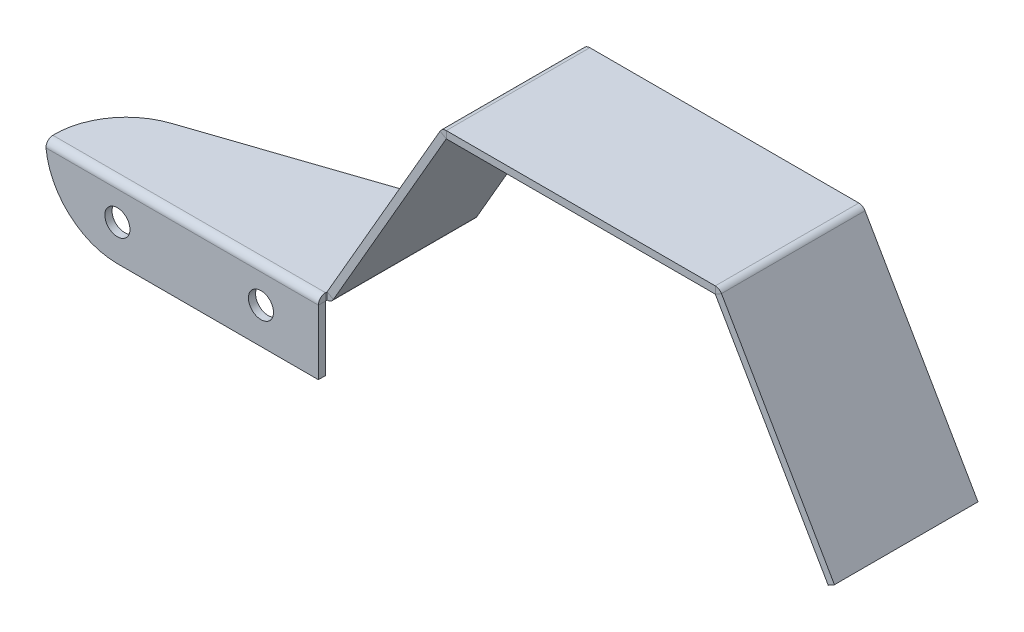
ISO-10303-21;
HEADER;
FILE_DESCRIPTION(('STEP AP214'),'2;1');
FILE_NAME('part.step','',(''),(''),'','','');
FILE_SCHEMA(('AUTOMOTIVE_DESIGN { 1 0 10303 214 1 1 1 1 }'));
ENDSEC;
DATA;
#1=APPLICATION_CONTEXT('core data for automotive mechanical design processes');
#2=APPLICATION_PROTOCOL_DEFINITION('international standard','automotive_design',2000,#1);
#3=PRODUCT_CONTEXT('',#1,'mechanical');
#4=PRODUCT('Part','Part','',(#3));
#5=PRODUCT_RELATED_PRODUCT_CATEGORY('part','',(#4));
#6=PRODUCT_DEFINITION_FORMATION('','',#4);
#7=PRODUCT_DEFINITION_CONTEXT('part definition',#1,'design');
#8=PRODUCT_DEFINITION('design','',#6,#7);
#9=PRODUCT_DEFINITION_SHAPE('','',#8);
#10=(LENGTH_UNIT() NAMED_UNIT(*) SI_UNIT(.MILLI.,.METRE.));
#11=(NAMED_UNIT(*) PLANE_ANGLE_UNIT() SI_UNIT($,.RADIAN.));
#12=(NAMED_UNIT(*) SI_UNIT($,.STERADIAN.) SOLID_ANGLE_UNIT());
#13=UNCERTAINTY_MEASURE_WITH_UNIT(LENGTH_MEASURE(1.E-05),#10,'distance_accuracy_value','');
#14=(GEOMETRIC_REPRESENTATION_CONTEXT(3) GLOBAL_UNCERTAINTY_ASSIGNED_CONTEXT((#13)) GLOBAL_UNIT_ASSIGNED_CONTEXT((#10,
#11,#12)) REPRESENTATION_CONTEXT('',''));
#15=CARTESIAN_POINT('',(0.,0.,0.));
#16=DIRECTION('',(0.,0.,1.));
#17=DIRECTION('',(1.,0.,0.));
#18=AXIS2_PLACEMENT_3D('',#15,#16,#17);
#19=CARTESIAN_POINT('',(-13.3954315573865,-25.202568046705,-1.21503104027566));
#20=DIRECTION('',(-0.86602540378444,0.499999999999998,0.));
#21=DIRECTION('',(0.499999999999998,0.86602540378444,0.));
#22=AXIS2_PLACEMENT_3D('',#19,#20,#21);
#23=PLANE('',#22);
#24=DIRECTION('',(-0.499999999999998,-0.86602540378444,0.));
#25=VECTOR('',#24,1.);
#26=CARTESIAN_POINT('',(51.6045684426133,87.3807344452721,-21.2150310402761));
#27=LINE('',#26,#25);
#28=CARTESIAN_POINT('',(16.6045684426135,26.7589561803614,-21.2150310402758));
#29=VERTEX_POINT('',#28);
#30=CARTESIAN_POINT('',(0.866891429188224,-0.499500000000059,-21.2150310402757));
#31=VERTEX_POINT('',#30);
#32=EDGE_CURVE('E247',#29,#31,#27,.T.);
#33=ORIENTED_EDGE('',*,*,#32,.F.);
#34=DIRECTION('',(0.,0.,1.));
#35=VECTOR('',#34,1.);
#36=CARTESIAN_POINT('',(16.6045684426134,26.7589561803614,-1.21503104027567));
#37=LINE('',#36,#35);
#38=CARTESIAN_POINT('',(16.6045684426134,26.7589561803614,-1.21503104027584));
#39=VERTEX_POINT('',#38);
#40=EDGE_CURVE('E485',#29,#39,#37,.T.);
#41=ORIENTED_EDGE('',*,*,#40,.T.);
#42=DIRECTION('',(0.499999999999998,0.86602540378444,0.));
#43=VECTOR('',#42,1.);
#44=CARTESIAN_POINT('',(0.604568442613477,-0.953856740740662,-1.21503104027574));
#45=LINE('',#44,#43);
#46=CARTESIAN_POINT('',(0.866891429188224,-0.499499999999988,-1.21503104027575));
#47=VERTEX_POINT('',#46);
#48=EDGE_CURVE('E266',#47,#39,#45,.T.);
#49=ORIENTED_EDGE('',*,*,#48,.F.);
#50=DIRECTION('',(0.,0.,-1.));
#51=VECTOR('',#50,1.);
#52=CARTESIAN_POINT('',(0.866891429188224,-0.499499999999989,-1.21503104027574));
#53=LINE('',#52,#51);
#54=EDGE_CURVE('E244',#47,#31,#53,.T.);
#55=ORIENTED_EDGE('',*,*,#54,.T.);
#56=EDGE_LOOP('',(#33,#41,#49,#55));
#57=FACE_BOUND('',#56,.T.);
#58=ADVANCED_FACE('F58',(#57),#23,.F.);
#59=CARTESIAN_POINT('',(-28.,0.,-1.21503104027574));
#60=DIRECTION('',(0.,1.,0.));
#61=DIRECTION('',(1.,0.,0.));
#62=AXIS2_PLACEMENT_3D('',#59,#60,#61);
#63=PLANE('',#62);
#64=DIRECTION('',(0.,0.,-1.));
#65=VECTOR('',#64,1.);
#66=CARTESIAN_POINT('',(0.,0.,-1.21503104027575));
#67=LINE('',#66,#65);
#68=CARTESIAN_POINT('',(0.,0.,-1.001));
#69=VERTEX_POINT('',#68);
#70=CARTESIAN_POINT('',(0.,0.,-1.21503104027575));
#71=VERTEX_POINT('',#70);
#72=EDGE_CURVE('E372',#69,#71,#67,.T.);
#73=ORIENTED_EDGE('',*,*,#72,.T.);
#74=DIRECTION('',(0.,0.,-1.));
#75=VECTOR('',#74,1.);
#76=CARTESIAN_POINT('',(0.,0.,-1.21503104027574));
#77=LINE('',#76,#75);
#78=CARTESIAN_POINT('',(0.,0.,-21.2150310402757));
#79=VERTEX_POINT('',#78);
#80=EDGE_CURVE('E474',#71,#79,#77,.T.);
#81=ORIENTED_EDGE('',*,*,#80,.T.);
#82=DIRECTION('',(-0.947530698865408,0.,0.319664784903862));
#83=VECTOR('',#82,1.);
#84=CARTESIAN_POINT('',(0.,0.,-21.2150310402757));
#85=LINE('',#84,#83);
#86=CARTESIAN_POINT('',(-31.1966478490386,0.,-10.6903380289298));
#87=VERTEX_POINT('',#86);
#88=EDGE_CURVE('E467',#79,#87,#85,.T.);
#89=ORIENTED_EDGE('',*,*,#88,.T.);
#90=CARTESIAN_POINT('',(-28.,0.,-1.21503104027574));
#91=DIRECTION('',(0.,1.,0.));
#92=DIRECTION('',(1.,0.,0.));
#93=AXIS2_PLACEMENT_3D('',#90,#91,#92);
#94=CIRCLE('',#93,10.);
#95=CARTESIAN_POINT('',(-37.9977092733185,0.,-1.001));
#96=VERTEX_POINT('',#95);
#97=EDGE_CURVE('E464',#87,#96,#94,.T.);
#98=ORIENTED_EDGE('',*,*,#97,.T.);
#99=DIRECTION('',(1.,0.,0.));
#100=VECTOR('',#99,1.);
#101=CARTESIAN_POINT('',(-28.,0.,-1.001));
#102=LINE('',#101,#100);
#103=EDGE_CURVE('E452',#96,#69,#102,.T.);
#104=ORIENTED_EDGE('',*,*,#103,.T.);
#105=EDGE_LOOP('',(#73,#81,#89,#98,#104));
#106=FACE_BOUND('',#105,.T.);
#107=ADVANCED_FACE('F438',(#106),#63,.T.);
#108=CARTESIAN_POINT('',(0.,-0.99999999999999,-1.21503104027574));
#109=DIRECTION('',(1.,0.,0.));
#110=DIRECTION('',(0.,0.,-1.));
#111=AXIS2_PLACEMENT_3D('',#108,#109,#110);
#112=PLANE('',#111);
#113=ORIENTED_EDGE('',*,*,#72,.F.);
#114=DIRECTION('',(0.,-1.,0.));
#115=VECTOR('',#114,1.);
#116=CARTESIAN_POINT('',(0.,-0.999999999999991,-1.001));
#117=LINE('',#116,#115);
#118=CARTESIAN_POINT('',(0.,-0.99999999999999,-1.001));
#119=VERTEX_POINT('',#118);
#120=EDGE_CURVE('E461',#69,#119,#117,.T.);
#121=ORIENTED_EDGE('',*,*,#120,.T.);
#122=DIRECTION('',(0.,0.,-1.));
#123=VECTOR('',#122,1.);
#124=CARTESIAN_POINT('',(0.,-0.99999999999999,-1.21503104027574));
#125=LINE('',#124,#123);
#126=CARTESIAN_POINT('',(0.,-0.99999999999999,-1.21503104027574));
#127=VERTEX_POINT('',#126);
#128=EDGE_CURVE('E466',#119,#127,#125,.T.);
#129=ORIENTED_EDGE('',*,*,#128,.T.);
#130=DIRECTION('',(0.,1.,0.));
#131=VECTOR('',#130,1.);
#132=CARTESIAN_POINT('',(0.,-0.99999999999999,-1.21503104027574));
#133=LINE('',#132,#131);
#134=EDGE_CURVE('E477',#127,#71,#133,.T.);
#135=ORIENTED_EDGE('',*,*,#134,.T.);
#136=EDGE_LOOP('',(#113,#121,#129,#135));
#137=FACE_BOUND('',#136,.T.);
#138=ADVANCED_FACE('F435',(#137),#112,.T.);
#139=CARTESIAN_POINT('',(-28.,-0.99999999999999,-1.21503104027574));
#140=DIRECTION('',(0.,1.,0.));
#141=DIRECTION('',(1.,0.,0.));
#142=AXIS2_PLACEMENT_3D('',#139,#140,#141);
#143=CYLINDRICAL_SURFACE('',#142,10.);
#144=CARTESIAN_POINT('',(-28.,-0.99999999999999,-1.21503104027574));
#145=DIRECTION('',(0.,1.,0.));
#146=DIRECTION('',(1.,0.,0.));
#147=AXIS2_PLACEMENT_3D('',#144,#145,#146);
#148=CIRCLE('',#147,10.);
#149=CARTESIAN_POINT('',(-31.1966478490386,-1.00000000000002,-10.6903380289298));
#150=VERTEX_POINT('',#149);
#151=CARTESIAN_POINT('',(-37.9977092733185,-0.99999999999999,-1.001));
#152=VERTEX_POINT('',#151);
#153=EDGE_CURVE('E612',#150,#152,#148,.T.);
#154=ORIENTED_EDGE('',*,*,#153,.T.);
#155=CARTESIAN_POINT('',(-37.9977092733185,0.,-1.001));
#156=CARTESIAN_POINT('',(-37.9977092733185,-0.99999999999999,-1.001));
#157=B_SPLINE_CURVE_WITH_KNOTS('',1,(#155,#156),.UNSPECIFIED.,.F.,.F.,(2,2),(0.,1.),.UNSPECIFIED.);
#158=EDGE_CURVE('E460',#152,#96,#157,.F.);
#159=ORIENTED_EDGE('',*,*,#158,.T.);
#160=ORIENTED_EDGE('',*,*,#97,.F.);
#161=DIRECTION('',(0.,1.,0.));
#162=VECTOR('',#161,1.);
#163=CARTESIAN_POINT('',(-31.1966478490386,-1.00000000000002,-10.6903380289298));
#164=LINE('',#163,#162);
#165=EDGE_CURVE('E986',#150,#87,#164,.T.);
#166=ORIENTED_EDGE('',*,*,#165,.F.);
#167=EDGE_LOOP('',(#154,#159,#160,#166));
#168=FACE_BOUND('',#167,.T.);
#169=ADVANCED_FACE('F433',(#168),#143,.T.);
#170=CARTESIAN_POINT('',(0.,-1.00000000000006,-21.2150310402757));
#171=DIRECTION('',(-0.319664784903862,0.,-0.947530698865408));
#172=DIRECTION('',(-0.947530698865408,0.,0.319664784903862));
#173=AXIS2_PLACEMENT_3D('',#170,#171,#172);
#174=PLANE('',#173);
#175=ORIENTED_EDGE('',*,*,#88,.F.);
#176=DIRECTION('',(0.,1.,0.));
#177=VECTOR('',#176,1.);
#178=CARTESIAN_POINT('',(0.,-1.00000000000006,-21.2150310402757));
#179=LINE('',#178,#177);
#180=CARTESIAN_POINT('',(0.,-1.00000000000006,-21.2150310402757));
#181=VERTEX_POINT('',#180);
#182=EDGE_CURVE('E472',#181,#79,#179,.T.);
#183=ORIENTED_EDGE('',*,*,#182,.F.);
#184=DIRECTION('',(-0.947530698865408,0.,0.319664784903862));
#185=VECTOR('',#184,1.);
#186=CARTESIAN_POINT('',(0.,-1.00000000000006,-21.2150310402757));
#187=LINE('',#186,#185);
#188=EDGE_CURVE('E609',#181,#150,#187,.T.);
#189=ORIENTED_EDGE('',*,*,#188,.T.);
#190=ORIENTED_EDGE('',*,*,#165,.T.);
#191=EDGE_LOOP('',(#175,#183,#189,#190));
#192=FACE_BOUND('',#191,.T.);
#193=ADVANCED_FACE('F429',(#192),#174,.T.);
#194=CARTESIAN_POINT('',(-28.,-0.99999999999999,-1.21503104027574));
#195=DIRECTION('',(0.,1.,0.));
#196=DIRECTION('',(1.,0.,0.));
#197=AXIS2_PLACEMENT_3D('',#194,#195,#196);
#198=PLANE('',#197);
#199=DIRECTION('',(0.,0.,-1.));
#200=VECTOR('',#199,1.);
#201=CARTESIAN_POINT('',(0.,-0.99999999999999,-1.21503104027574));
#202=LINE('',#201,#200);
#203=EDGE_CURVE('E470',#127,#181,#202,.T.);
#204=ORIENTED_EDGE('',*,*,#203,.F.);
#205=ORIENTED_EDGE('',*,*,#128,.F.);
#206=DIRECTION('',(1.,0.,0.));
#207=VECTOR('',#206,1.);
#208=CARTESIAN_POINT('',(-28.,-0.99999999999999,-1.001));
#209=LINE('',#208,#207);
#210=EDGE_CURVE('E988',#152,#119,#209,.T.);
#211=ORIENTED_EDGE('',*,*,#210,.F.);
#212=ORIENTED_EDGE('',*,*,#153,.F.);
#213=ORIENTED_EDGE('',*,*,#188,.F.);
#214=EDGE_LOOP('',(#204,#205,#211,#212,#213));
#215=FACE_BOUND('',#214,.T.);
#216=ADVANCED_FACE('F432',(#215),#198,.F.);
#217=CARTESIAN_POINT('',(0.,-10.,-1.));
#218=DIRECTION('',(0.,-1.,0.));
#219=DIRECTION('',(1.,0.,0.));
#220=AXIS2_PLACEMENT_3D('',#217,#218,#219);
#221=PLANE('',#220);
#222=DIRECTION('',(1.,0.,0.));
#223=VECTOR('',#222,1.);
#224=CARTESIAN_POINT('',(0.,-10.,0.));
#225=LINE('',#224,#223);
#226=CARTESIAN_POINT('',(-28.,-10.,0.));
#227=VERTEX_POINT('',#226);
#228=CARTESIAN_POINT('',(0.,-10.,0.));
#229=VERTEX_POINT('',#228);
#230=EDGE_CURVE('E376',#227,#229,#225,.T.);
#231=ORIENTED_EDGE('',*,*,#230,.F.);
#232=DIRECTION('',(0.,0.,1.));
#233=VECTOR('',#232,1.);
#234=CARTESIAN_POINT('',(-28.,-10.,-1.));
#235=LINE('',#234,#233);
#236=CARTESIAN_POINT('',(-28.,-10.,-1.));
#237=VERTEX_POINT('',#236);
#238=EDGE_CURVE('E364',#237,#227,#235,.T.);
#239=ORIENTED_EDGE('',*,*,#238,.F.);
#240=DIRECTION('',(1.,0.,0.));
#241=VECTOR('',#240,1.);
#242=CARTESIAN_POINT('',(0.,-10.,-1.));
#243=LINE('',#242,#241);
#244=CARTESIAN_POINT('',(0.,-10.,-1.));
#245=VERTEX_POINT('',#244);
#246=EDGE_CURVE('E397',#237,#245,#243,.T.);
#247=ORIENTED_EDGE('',*,*,#246,.T.);
#248=DIRECTION('',(0.,0.,1.));
#249=VECTOR('',#248,1.);
#250=CARTESIAN_POINT('',(0.,-10.,-1.));
#251=LINE('',#250,#249);
#252=EDGE_CURVE('E395',#245,#229,#251,.T.);
#253=ORIENTED_EDGE('',*,*,#252,.T.);
#254=EDGE_LOOP('',(#231,#239,#247,#253));
#255=FACE_BOUND('',#254,.T.);
#256=ADVANCED_FACE('F337',(#255),#221,.T.);
#257=CARTESIAN_POINT('',(-28.,-5.,-1.));
#258=DIRECTION('',(0.,0.,1.));
#259=DIRECTION('',(1.,0.,0.));
#260=AXIS2_PLACEMENT_3D('',#257,#258,#259);
#261=CYLINDRICAL_SURFACE('',#260,1.75);
#262=CARTESIAN_POINT('',(-28.,-5.,-1.));
#263=DIRECTION('',(0.,0.,1.));
#264=DIRECTION('',(1.,0.,0.));
#265=AXIS2_PLACEMENT_3D('',#262,#263,#264);
#266=CIRCLE('',#265,1.75);
#267=CARTESIAN_POINT('',(-26.25,-5.,-1.));
#268=VERTEX_POINT('',#267);
#269=EDGE_CURVE('E383',#268,#268,#266,.T.);
#270=ORIENTED_EDGE('',*,*,#269,.F.);
#271=EDGE_LOOP('',(#270));
#272=FACE_BOUND('',#271,.T.);
#273=CARTESIAN_POINT('',(-28.,-5.,0.));
#274=DIRECTION('',(0.,0.,1.));
#275=DIRECTION('',(1.,0.,0.));
#276=AXIS2_PLACEMENT_3D('',#273,#274,#275);
#277=CIRCLE('',#276,1.75);
#278=CARTESIAN_POINT('',(-26.25,-5.,0.));
#279=VERTEX_POINT('',#278);
#280=EDGE_CURVE('E392',#279,#279,#277,.T.);
#281=ORIENTED_EDGE('',*,*,#280,.T.);
#282=EDGE_LOOP('',(#281));
#283=FACE_BOUND('',#282,.T.);
#284=ADVANCED_FACE('F895',(#272,#283),#261,.F.);
#285=CARTESIAN_POINT('',(-8.,-5.,-1.));
#286=DIRECTION('',(0.,0.,1.));
#287=DIRECTION('',(1.,0.,0.));
#288=AXIS2_PLACEMENT_3D('',#285,#286,#287);
#289=CYLINDRICAL_SURFACE('',#288,1.75);
#290=CARTESIAN_POINT('',(-8.,-5.,-1.));
#291=DIRECTION('',(0.,0.,1.));
#292=DIRECTION('',(1.,0.,0.));
#293=AXIS2_PLACEMENT_3D('',#290,#291,#292);
#294=CIRCLE('',#293,1.75);
#295=CARTESIAN_POINT('',(-6.25,-5.,-1.));
#296=VERTEX_POINT('',#295);
#297=EDGE_CURVE('E386',#296,#296,#294,.T.);
#298=ORIENTED_EDGE('',*,*,#297,.F.);
#299=EDGE_LOOP('',(#298));
#300=FACE_BOUND('',#299,.T.);
#301=CARTESIAN_POINT('',(-8.,-5.,0.));
#302=DIRECTION('',(0.,0.,1.));
#303=DIRECTION('',(1.,0.,0.));
#304=AXIS2_PLACEMENT_3D('',#301,#302,#303);
#305=CIRCLE('',#304,1.75);
#306=CARTESIAN_POINT('',(-6.25,-5.,0.));
#307=VERTEX_POINT('',#306);
#308=EDGE_CURVE('E389',#307,#307,#305,.T.);
#309=ORIENTED_EDGE('',*,*,#308,.T.);
#310=EDGE_LOOP('',(#309));
#311=FACE_BOUND('',#310,.T.);
#312=ADVANCED_FACE('F886',(#300,#311),#289,.F.);
#313=CARTESIAN_POINT('',(-28.,0.,-1.));
#314=DIRECTION('',(0.,0.,1.));
#315=DIRECTION('',(1.,0.,0.));
#316=AXIS2_PLACEMENT_3D('',#313,#314,#315);
#317=PLANE('',#316);
#318=ORIENTED_EDGE('',*,*,#297,.T.);
#319=EDGE_LOOP('',(#318));
#320=FACE_BOUND('',#319,.T.);
#321=ORIENTED_EDGE('',*,*,#269,.T.);
#322=EDGE_LOOP('',(#321));
#323=FACE_BOUND('',#322,.T.);
#324=CARTESIAN_POINT('',(-28.,0.,-1.));
#325=DIRECTION('',(0.,0.,1.));
#326=DIRECTION('',(1.,0.,0.));
#327=AXIS2_PLACEMENT_3D('',#324,#325,#326);
#328=CIRCLE('',#327,10.);
#329=CARTESIAN_POINT('',(-37.9497738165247,-1.00099999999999,-1.));
#330=VERTEX_POINT('',#329);
#331=EDGE_CURVE('E373',#330,#237,#328,.T.);
#332=ORIENTED_EDGE('',*,*,#331,.F.);
#333=DIRECTION('',(1.,0.,0.));
#334=VECTOR('',#333,1.);
#335=CARTESIAN_POINT('',(-28.,-1.00099999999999,-1.));
#336=LINE('',#335,#334);
#337=CARTESIAN_POINT('',(0.,-1.00099999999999,-1.));
#338=VERTEX_POINT('',#337);
#339=EDGE_CURVE('E382',#330,#338,#336,.T.);
#340=ORIENTED_EDGE('',*,*,#339,.T.);
#341=DIRECTION('',(0.,1.,0.));
#342=VECTOR('',#341,1.);
#343=CARTESIAN_POINT('',(0.,0.,-1.));
#344=LINE('',#343,#342);
#345=EDGE_CURVE('E380',#245,#338,#344,.T.);
#346=ORIENTED_EDGE('',*,*,#345,.F.);
#347=ORIENTED_EDGE('',*,*,#246,.F.);
#348=EDGE_LOOP('',(#332,#340,#346,#347));
#349=FACE_BOUND('',#348,.T.);
#350=ADVANCED_FACE('F877',(#320,#323,#349),#317,.F.);
#351=CARTESIAN_POINT('',(0.,0.,-1.));
#352=DIRECTION('',(1.,0.,0.));
#353=DIRECTION('',(0.,1.,0.));
#354=AXIS2_PLACEMENT_3D('',#351,#352,#353);
#355=PLANE('',#354);
#356=DIRECTION('',(0.,0.,-1.));
#357=VECTOR('',#356,1.);
#358=CARTESIAN_POINT('',(0.,-1.00099999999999,-1.00000000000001));
#359=LINE('',#358,#357);
#360=CARTESIAN_POINT('',(0.,-1.001,0.));
#361=VERTEX_POINT('',#360);
#362=EDGE_CURVE('E400',#361,#338,#359,.T.);
#363=ORIENTED_EDGE('',*,*,#362,.F.);
#364=DIRECTION('',(0.,1.,0.));
#365=VECTOR('',#364,1.);
#366=CARTESIAN_POINT('',(0.,0.,0.));
#367=LINE('',#366,#365);
#368=EDGE_CURVE('E374',#229,#361,#367,.T.);
#369=ORIENTED_EDGE('',*,*,#368,.F.);
#370=ORIENTED_EDGE('',*,*,#252,.F.);
#371=ORIENTED_EDGE('',*,*,#345,.T.);
#372=EDGE_LOOP('',(#363,#369,#370,#371));
#373=FACE_BOUND('',#372,.T.);
#374=ADVANCED_FACE('F868',(#373),#355,.T.);
#375=CARTESIAN_POINT('',(-28.,0.,0.));
#376=DIRECTION('',(0.,0.,1.));
#377=DIRECTION('',(1.,0.,0.));
#378=AXIS2_PLACEMENT_3D('',#375,#376,#377);
#379=PLANE('',#378);
#380=DIRECTION('',(1.,0.,0.));
#381=VECTOR('',#380,1.);
#382=CARTESIAN_POINT('',(-28.,-1.001,0.));
#383=LINE('',#382,#381);
#384=CARTESIAN_POINT('',(-37.9497738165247,-1.001,0.));
#385=VERTEX_POINT('',#384);
#386=EDGE_CURVE('E403',#385,#361,#383,.T.);
#387=ORIENTED_EDGE('',*,*,#386,.F.);
#388=CARTESIAN_POINT('',(-28.,0.,0.));
#389=DIRECTION('',(0.,0.,1.));
#390=DIRECTION('',(1.,0.,0.));
#391=AXIS2_PLACEMENT_3D('',#388,#389,#390);
#392=CIRCLE('',#391,10.);
#393=EDGE_CURVE('E379',#385,#227,#392,.T.);
#394=ORIENTED_EDGE('',*,*,#393,.T.);
#395=ORIENTED_EDGE('',*,*,#230,.T.);
#396=ORIENTED_EDGE('',*,*,#368,.T.);
#397=EDGE_LOOP('',(#387,#394,#395,#396));
#398=FACE_BOUND('',#397,.T.);
#399=ORIENTED_EDGE('',*,*,#280,.F.);
#400=EDGE_LOOP('',(#399));
#401=FACE_BOUND('',#400,.T.);
#402=ORIENTED_EDGE('',*,*,#308,.F.);
#403=EDGE_LOOP('',(#402));
#404=FACE_BOUND('',#403,.T.);
#405=ADVANCED_FACE('F427',(#398,#401,#404),#379,.T.);
#406=CARTESIAN_POINT('',(-28.,0.,-1.));
#407=DIRECTION('',(0.,0.,1.));
#408=DIRECTION('',(1.,0.,0.));
#409=AXIS2_PLACEMENT_3D('',#406,#407,#408);
#410=CYLINDRICAL_SURFACE('',#409,10.);
#411=CARTESIAN_POINT('',(-37.9497738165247,-1.00099999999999,-1.));
#412=CARTESIAN_POINT('',(-37.9497738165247,-1.00099999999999,0.));
#413=B_SPLINE_CURVE_WITH_KNOTS('',1,(#411,#412),.UNSPECIFIED.,.F.,.F.,(2,2),(0.,1.),.UNSPECIFIED.);
#414=EDGE_CURVE('E272',#330,#385,#413,.T.);
#415=ORIENTED_EDGE('',*,*,#414,.F.);
#416=ORIENTED_EDGE('',*,*,#331,.T.);
#417=ORIENTED_EDGE('',*,*,#238,.T.);
#418=ORIENTED_EDGE('',*,*,#393,.F.);
#419=EDGE_LOOP('',(#415,#416,#417,#418));
#420=FACE_BOUND('',#419,.T.);
#421=ADVANCED_FACE('F336',(#420),#410,.T.);
#422=CARTESIAN_POINT('',(-37.9497738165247,-1.00099999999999,0.));
#423=CARTESIAN_POINT('',(-37.9549414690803,-0.878717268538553,0.));
#424=CARTESIAN_POINT('',(-37.9598186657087,-0.754071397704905,-0.0226984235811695));
#425=CARTESIAN_POINT('',(-37.9689825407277,-0.518152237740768,-0.115050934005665));
#426=CARTESIAN_POINT('',(-37.9732708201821,-0.406941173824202,-0.184749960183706));
#427=CARTESIAN_POINT('',(-37.9812600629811,-0.216862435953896,-0.365155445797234));
#428=CARTESIAN_POINT('',(-37.9849610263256,-0.138121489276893,-0.475861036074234));
#429=CARTESIAN_POINT('',(-37.9917756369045,-0.029624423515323,-0.723944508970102));
#430=CARTESIAN_POINT('',(-37.9948873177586,0.,-0.861161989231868));
#431=CARTESIAN_POINT('',(-37.9977092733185,0.,-1.001));
#432=CARTESIAN_POINT('',(-37.9497738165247,-1.00099999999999,-1.));
#433=CARTESIAN_POINT('',(-37.9549430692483,-1.00087780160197,-1.));
#434=CARTESIAN_POINT('',(-37.9598186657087,-1.00075331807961,-1.00002267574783));
#435=CARTESIAN_POINT('',(-37.9689825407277,-1.00051763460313,-1.00011493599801));
#436=CARTESIAN_POINT('',(-37.9732708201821,-1.00040653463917,-1.00018456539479));
#437=CARTESIAN_POINT('',(-37.9812600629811,-1.00021664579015,-1.00036479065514));
#438=CARTESIAN_POINT('',(-37.9849610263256,-1.00013798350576,-1.00047538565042));
#439=CARTESIAN_POINT('',(-37.9917756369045,-1.00002959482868,-1.00072322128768));
#440=CARTESIAN_POINT('',(-37.9948892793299,-0.99999999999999,-1.00086039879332));
#441=CARTESIAN_POINT('',(-37.9977092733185,-0.99999999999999,-1.001));
#442=B_SPLINE_SURFACE_WITH_KNOTS('',1,3,((#422,#423,#424,#425,#426,#427,#428,#429,#430,#431),
(#432,#433,#434,#435,#436,#437,#438,#439,#440,#441)),.UNSPECIFIED.,.F.,.F.,.F.,(2,2),(4,2,2,2,
4),(0.,1.),(0.,0.25,0.5,0.75,1.),.UNSPECIFIED.);
#443=CARTESIAN_POINT('',(-37.9497738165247,-1.00099999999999,0.));
#444=CARTESIAN_POINT('',(-37.9549414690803,-0.878717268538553,0.));
#445=CARTESIAN_POINT('',(-37.9598186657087,-0.754071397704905,-0.0226984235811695));
#446=CARTESIAN_POINT('',(-37.9689825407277,-0.518152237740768,-0.115050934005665));
#447=CARTESIAN_POINT('',(-37.9732708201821,-0.406941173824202,-0.184749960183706));
#448=CARTESIAN_POINT('',(-37.9812600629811,-0.216862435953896,-0.365155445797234));
#449=CARTESIAN_POINT('',(-37.9849610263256,-0.138121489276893,-0.475861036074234));
#450=CARTESIAN_POINT('',(-37.9917756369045,-0.029624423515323,-0.723944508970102));
#451=CARTESIAN_POINT('',(-37.9948873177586,0.,-0.861161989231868));
#452=CARTESIAN_POINT('',(-37.9977092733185,0.,-1.001));
#453=B_SPLINE_CURVE_WITH_KNOTS('',3,(#443,#444,#445,#446,#447,#448,#449,#450,#451,#452),
.UNSPECIFIED.,.F.,.F.,(4,2,2,2,4),(0.,0.25,0.5,0.75,1.),.UNSPECIFIED.);
#454=EDGE_CURVE('E263',#385,#96,#453,.T.);
#455=CARTESIAN_POINT('',(-37.9977092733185,-0.99999999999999,-1.001));
#456=CARTESIAN_POINT('',(-37.9948892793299,-0.99999999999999,-1.00086039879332));
#457=CARTESIAN_POINT('',(-37.9917756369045,-1.00002959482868,-1.00072322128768));
#458=CARTESIAN_POINT('',(-37.9849610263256,-1.00013798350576,-1.00047538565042));
#459=CARTESIAN_POINT('',(-37.9812600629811,-1.00021664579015,-1.00036479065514));
#460=CARTESIAN_POINT('',(-37.9732708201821,-1.00040653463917,-1.00018456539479));
#461=CARTESIAN_POINT('',(-37.9689825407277,-1.00051763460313,-1.00011493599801));
#462=CARTESIAN_POINT('',(-37.9598186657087,-1.00075331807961,-1.00002267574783));
#463=CARTESIAN_POINT('',(-37.9549430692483,-1.00087780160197,-1.));
#464=CARTESIAN_POINT('',(-37.9497738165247,-1.00099999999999,-1.));
#465=B_SPLINE_CURVE_WITH_KNOTS('',3,(#455,#456,#457,#458,#459,#460,#461,#462,#463,#464),
.UNSPECIFIED.,.F.,.F.,(4,2,2,2,4),(0.,0.25,0.5,0.75,1.),.UNSPECIFIED.);
#466=EDGE_CURVE('E273',#330,#152,#465,.F.);
#467=ORIENTED_EDGE('',*,*,#414,.T.);
#468=ORIENTED_EDGE('',*,*,#454,.T.);
#469=ORIENTED_EDGE('',*,*,#158,.F.);
#470=ORIENTED_EDGE('',*,*,#466,.F.);
#471=EDGE_LOOP('',(#467,#468,#469,#470));
#472=FACE_BOUND('',#471,.T.);
#473=ADVANCED_FACE('F325',(#472),#442,.F.);
#474=CARTESIAN_POINT('',(0.,-1.00099999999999,-1.001));
#475=DIRECTION('',(-1.,0.,0.));
#476=DIRECTION('',(0.,0.,1.));
#477=AXIS2_PLACEMENT_3D('',#474,#475,#476);
#478=PLANE('',#477);
#479=ORIENTED_EDGE('',*,*,#120,.F.);
#480=CARTESIAN_POINT('',(0.,-1.00099999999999,-1.001));
#481=DIRECTION('',(1.,0.,0.));
#482=DIRECTION('',(0.,0.,-1.));
#483=AXIS2_PLACEMENT_3D('',#480,#481,#482);
#484=CIRCLE('',#483,1.001);
#485=EDGE_CURVE('E274',#69,#361,#484,.T.);
#486=ORIENTED_EDGE('',*,*,#485,.T.);
#487=ORIENTED_EDGE('',*,*,#362,.T.);
#488=CARTESIAN_POINT('',(0.,-1.00099999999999,-1.001));
#489=DIRECTION('',(1.,0.,0.));
#490=DIRECTION('',(0.,0.,1.));
#491=AXIS2_PLACEMENT_3D('',#488,#489,#490);
#492=CIRCLE('',#491,0.000999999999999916);
#493=EDGE_CURVE('E269',#119,#338,#492,.T.);
#494=ORIENTED_EDGE('',*,*,#493,.F.);
#495=EDGE_LOOP('',(#479,#486,#487,#494));
#496=FACE_BOUND('',#495,.T.);
#497=ADVANCED_FACE('F294',(#496),#478,.F.);
#498=CARTESIAN_POINT('',(-56.9938983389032,-1.00099999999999,-1.001));
#499=DIRECTION('',(1.,0.,0.));
#500=DIRECTION('',(0.,0.,-1.));
#501=AXIS2_PLACEMENT_3D('',#498,#499,#500);
#502=CYLINDRICAL_SURFACE('',#501,0.001);
#503=ORIENTED_EDGE('',*,*,#493,.T.);
#504=ORIENTED_EDGE('',*,*,#339,.F.);
#505=ORIENTED_EDGE('',*,*,#466,.T.);
#506=ORIENTED_EDGE('',*,*,#210,.T.);
#507=EDGE_LOOP('',(#503,#504,#505,#506));
#508=FACE_BOUND('',#507,.T.);
#509=ADVANCED_FACE('F283',(#508),#502,.F.);
#510=CARTESIAN_POINT('',(-56.9938983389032,-1.00099999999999,-1.001));
#511=DIRECTION('',(1.,0.,0.));
#512=DIRECTION('',(0.,0.,-1.));
#513=AXIS2_PLACEMENT_3D('',#510,#511,#512);
#514=CYLINDRICAL_SURFACE('',#513,1.001);
#515=ORIENTED_EDGE('',*,*,#485,.F.);
#516=ORIENTED_EDGE('',*,*,#103,.F.);
#517=ORIENTED_EDGE('',*,*,#454,.F.);
#518=ORIENTED_EDGE('',*,*,#386,.T.);
#519=EDGE_LOOP('',(#515,#516,#517,#518));
#520=FACE_BOUND('',#519,.T.);
#521=ADVANCED_FACE('F293',(#520),#514,.T.);
#522=CARTESIAN_POINT('',(0.,0.00100000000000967,-1.21503104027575));
#523=DIRECTION('',(0.,0.,1.));
#524=DIRECTION('',(0.,-1.,0.));
#525=AXIS2_PLACEMENT_3D('',#522,#523,#524);
#526=PLANE('',#525);
#527=DIRECTION('',(-0.86602540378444,0.499999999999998,0.));
#528=VECTOR('',#527,1.);
#529=CARTESIAN_POINT('',(0.866891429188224,-0.499499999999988,-1.21503104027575));
#530=LINE('',#529,#528);
#531=CARTESIAN_POINT('',(0.000866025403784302,0.000500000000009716,-1.21503104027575));
#532=VERTEX_POINT('',#531);
#533=EDGE_CURVE('E243',#47,#532,#530,.T.);
#534=ORIENTED_EDGE('',*,*,#533,.T.);
#535=CARTESIAN_POINT('',(0.,0.00100000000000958,-1.21503104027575));
#536=DIRECTION('',(0.,0.,1.));
#537=DIRECTION('',(0.,-1.,0.));
#538=AXIS2_PLACEMENT_3D('',#535,#536,#537);
#539=CIRCLE('',#538,0.000999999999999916);
#540=EDGE_CURVE('E264',#532,#71,#539,.F.);
#541=ORIENTED_EDGE('',*,*,#540,.T.);
#542=ORIENTED_EDGE('',*,*,#134,.F.);
#543=CARTESIAN_POINT('',(0.,0.00100000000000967,-1.21503104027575));
#544=DIRECTION('',(0.,0.,-1.));
#545=DIRECTION('',(0.,-1.,0.));
#546=AXIS2_PLACEMENT_3D('',#543,#544,#545);
#547=CIRCLE('',#546,1.001);
#548=EDGE_CURVE('E256',#47,#127,#547,.T.);
#549=ORIENTED_EDGE('',*,*,#548,.F.);
#550=EDGE_LOOP('',(#534,#541,#542,#549));
#551=FACE_BOUND('',#550,.T.);
#552=ADVANCED_FACE('F301',(#551),#526,.T.);
#553=CARTESIAN_POINT('',(0.,0.000999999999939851,-21.2150310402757));
#554=DIRECTION('',(0.,0.,-1.));
#555=DIRECTION('',(0.,1.,0.));
#556=AXIS2_PLACEMENT_3D('',#553,#554,#555);
#557=PLANE('',#556);
#558=CARTESIAN_POINT('',(0.,0.000999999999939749,-21.2150310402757));
#559=DIRECTION('',(0.,0.,1.));
#560=DIRECTION('',(0.,-1.,0.));
#561=AXIS2_PLACEMENT_3D('',#558,#559,#560);
#562=CIRCLE('',#561,0.000999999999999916);
#563=CARTESIAN_POINT('',(0.000866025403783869,0.000499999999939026,-21.2150310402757));
#564=VERTEX_POINT('',#563);
#565=EDGE_CURVE('E260',#79,#564,#562,.T.);
#566=ORIENTED_EDGE('',*,*,#565,.T.);
#567=DIRECTION('',(0.86602540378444,-0.499999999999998,0.));
#568=VECTOR('',#567,1.);
#569=CARTESIAN_POINT('',(0.866891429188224,-0.499500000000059,-21.2150310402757));
#570=LINE('',#569,#568);
#571=EDGE_CURVE('E248',#564,#31,#570,.T.);
#572=ORIENTED_EDGE('',*,*,#571,.T.);
#573=CARTESIAN_POINT('',(0.,0.000999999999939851,-21.2150310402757));
#574=DIRECTION('',(0.,0.,1.));
#575=DIRECTION('',(0.,1.,0.));
#576=AXIS2_PLACEMENT_3D('',#573,#574,#575);
#577=CIRCLE('',#576,1.001);
#578=EDGE_CURVE('E259',#181,#31,#577,.T.);
#579=ORIENTED_EDGE('',*,*,#578,.F.);
#580=ORIENTED_EDGE('',*,*,#182,.T.);
#581=EDGE_LOOP('',(#566,#572,#579,#580));
#582=FACE_BOUND('',#581,.T.);
#583=ADVANCED_FACE('F296',(#582),#557,.T.);
#584=CARTESIAN_POINT('',(0.,0.000999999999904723,-31.2468870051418));
#585=DIRECTION('',(0.,0.,1.));
#586=DIRECTION('',(0.,-1.,0.));
#587=AXIS2_PLACEMENT_3D('',#584,#585,#586);
#588=CYLINDRICAL_SURFACE('',#587,1.001);
#589=ORIENTED_EDGE('',*,*,#203,.T.);
#590=ORIENTED_EDGE('',*,*,#578,.T.);
#591=ORIENTED_EDGE('',*,*,#54,.F.);
#592=ORIENTED_EDGE('',*,*,#548,.T.);
#593=EDGE_LOOP('',(#589,#590,#591,#592));
#594=FACE_BOUND('',#593,.T.);
#595=ADVANCED_FACE('F602',(#594),#588,.T.);
#596=CARTESIAN_POINT('',(0.,0.000999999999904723,-31.2468870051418));
#597=DIRECTION('',(0.,0.,1.));
#598=DIRECTION('',(0.,-1.,0.));
#599=AXIS2_PLACEMENT_3D('',#596,#597,#598);
#600=CYLINDRICAL_SURFACE('',#599,0.000999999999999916);
#601=ORIENTED_EDGE('',*,*,#80,.F.);
#602=ORIENTED_EDGE('',*,*,#540,.F.);
#603=DIRECTION('',(0.,0.,-1.));
#604=VECTOR('',#603,1.);
#605=CARTESIAN_POINT('',(0.000866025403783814,0.000500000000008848,-1.21503104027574));
#606=LINE('',#605,#604);
#607=EDGE_CURVE('E251',#532,#564,#606,.T.);
#608=ORIENTED_EDGE('',*,*,#607,.T.);
#609=ORIENTED_EDGE('',*,*,#565,.F.);
#610=EDGE_LOOP('',(#601,#602,#608,#609));
#611=FACE_BOUND('',#610,.T.);
#612=ADVANCED_FACE('F590',(#611),#600,.F.);
#613=CARTESIAN_POINT('',(51.6045684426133,87.3807344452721,-21.2150310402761));
#614=DIRECTION('',(0.,0.,-1.));
#615=DIRECTION('',(-0.499999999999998,-0.86602540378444,0.));
#616=AXIS2_PLACEMENT_3D('',#613,#614,#615);
#617=PLANE('',#616);
#618=DIRECTION('',(-0.86602540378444,0.499999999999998,0.));
#619=VECTOR('',#618,1.);
#620=CARTESIAN_POINT('',(16.6045684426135,26.7589561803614,-21.2150310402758));
#621=LINE('',#620,#619);
#622=CARTESIAN_POINT('',(15.738543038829,27.2589561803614,-21.2150310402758));
#623=VERTEX_POINT('',#622);
#624=EDGE_CURVE('E488',#29,#623,#621,.T.);
#625=ORIENTED_EDGE('',*,*,#624,.F.);
#626=ORIENTED_EDGE('',*,*,#32,.T.);
#627=ORIENTED_EDGE('',*,*,#571,.F.);
#628=DIRECTION('',(-0.499999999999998,-0.86602540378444,0.));
#629=VECTOR('',#628,1.);
#630=CARTESIAN_POINT('',(50.7385430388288,87.8807344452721,-21.2150310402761));
#631=LINE('',#630,#629);
#632=EDGE_CURVE('E496',#623,#564,#631,.T.);
#633=ORIENTED_EDGE('',*,*,#632,.F.);
#634=EDGE_LOOP('',(#625,#626,#627,#633));
#635=FACE_BOUND('',#634,.T.);
#636=ADVANCED_FACE('F556',(#635),#617,.T.);
#637=CARTESIAN_POINT('',(-14.2614569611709,-24.702568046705,-1.21503104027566));
#638=DIRECTION('',(-0.86602540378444,0.499999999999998,0.));
#639=DIRECTION('',(0.499999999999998,0.86602540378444,0.));
#640=AXIS2_PLACEMENT_3D('',#637,#638,#639);
#641=PLANE('',#640);
#642=DIRECTION('',(0.,0.,1.));
#643=VECTOR('',#642,1.);
#644=CARTESIAN_POINT('',(15.738543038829,27.2589561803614,-1.21503104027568));
#645=LINE('',#644,#643);
#646=CARTESIAN_POINT('',(15.738543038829,27.2589561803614,-1.21503104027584));
#647=VERTEX_POINT('',#646);
#648=EDGE_CURVE('E480',#623,#647,#645,.T.);
#649=ORIENTED_EDGE('',*,*,#648,.F.);
#650=ORIENTED_EDGE('',*,*,#632,.T.);
#651=ORIENTED_EDGE('',*,*,#607,.F.);
#652=DIRECTION('',(0.499999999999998,0.86602540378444,0.));
#653=VECTOR('',#652,1.);
#654=CARTESIAN_POINT('',(-0.261456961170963,-0.453856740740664,-1.21503104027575));
#655=LINE('',#654,#653);
#656=EDGE_CURVE('E493',#532,#647,#655,.T.);
#657=ORIENTED_EDGE('',*,*,#656,.T.);
#658=EDGE_LOOP('',(#649,#650,#651,#657));
#659=FACE_BOUND('',#658,.T.);
#660=ADVANCED_FACE('F561',(#659),#641,.T.);
#661=CARTESIAN_POINT('',(0.604568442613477,-0.953856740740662,-1.21503104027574));
#662=DIRECTION('',(0.,0.,1.));
#663=DIRECTION('',(0.86602540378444,-0.499999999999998,0.));
#664=AXIS2_PLACEMENT_3D('',#661,#662,#663);
#665=PLANE('',#664);
#666=DIRECTION('',(0.86602540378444,-0.499999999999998,0.));
#667=VECTOR('',#666,1.);
#668=CARTESIAN_POINT('',(16.6045684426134,26.7589561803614,-1.21503104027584));
#669=LINE('',#668,#667);
#670=EDGE_CURVE('E483',#647,#39,#669,.T.);
#671=ORIENTED_EDGE('',*,*,#670,.F.);
#672=ORIENTED_EDGE('',*,*,#656,.F.);
#673=ORIENTED_EDGE('',*,*,#533,.F.);
#674=ORIENTED_EDGE('',*,*,#48,.T.);
#675=EDGE_LOOP('',(#671,#672,#673,#674));
#676=FACE_BOUND('',#675,.T.);
#677=ADVANCED_FACE('F557',(#676),#665,.T.);
#678=CARTESIAN_POINT('',(16.6045684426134,26.7589561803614,-1.21503104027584));
#679=DIRECTION('',(0.,0.,1.));
#680=DIRECTION('',(1.,0.,0.));
#681=AXIS2_PLACEMENT_3D('',#678,#679,#680);
#682=CYLINDRICAL_SURFACE('',#681,1.);
#683=CARTESIAN_POINT('',(16.6045684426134,26.7589561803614,-1.21503104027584));
#684=DIRECTION('',(0.,0.,1.));
#685=DIRECTION('',(1.,0.,0.));
#686=AXIS2_PLACEMENT_3D('',#683,#684,#685);
#687=CIRCLE('',#686,1.);
#688=CARTESIAN_POINT('',(16.6045684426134,27.7589561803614,-1.21503104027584));
#689=VERTEX_POINT('',#688);
#690=EDGE_CURVE('E240',#689,#647,#687,.T.);
#691=ORIENTED_EDGE('',*,*,#690,.F.);
#692=DIRECTION('',(0.,0.,1.));
#693=VECTOR('',#692,1.);
#694=CARTESIAN_POINT('',(16.6045684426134,27.7589561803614,-1.21503104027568));
#695=LINE('',#694,#693);
#696=CARTESIAN_POINT('',(16.6045684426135,27.7589561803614,-21.2150310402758));
#697=VERTEX_POINT('',#696);
#698=EDGE_CURVE('E236',#697,#689,#695,.T.);
#699=ORIENTED_EDGE('',*,*,#698,.F.);
#700=CARTESIAN_POINT('',(16.6045684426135,26.7589561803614,-21.2150310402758));
#701=DIRECTION('',(0.,0.,1.));
#702=DIRECTION('',(1.,0.,0.));
#703=AXIS2_PLACEMENT_3D('',#700,#701,#702);
#704=CIRCLE('',#703,1.);
#705=EDGE_CURVE('E231',#697,#623,#704,.T.);
#706=ORIENTED_EDGE('',*,*,#705,.T.);
#707=ORIENTED_EDGE('',*,*,#648,.T.);
#708=EDGE_LOOP('',(#691,#699,#706,#707));
#709=FACE_BOUND('',#708,.T.);
#710=ADVANCED_FACE('F560',(#709),#682,.T.);
#711=CARTESIAN_POINT('',(16.6045684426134,26.7589561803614,-1.21503104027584));
#712=DIRECTION('',(0.,0.,-1.));
#713=DIRECTION('',(-1.,0.,0.));
#714=AXIS2_PLACEMENT_3D('',#711,#712,#713);
#715=PLANE('',#714);
#716=ORIENTED_EDGE('',*,*,#670,.T.);
#717=DIRECTION('',(0.,-1.,0.));
#718=VECTOR('',#717,1.);
#719=CARTESIAN_POINT('',(16.6045684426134,26.7589561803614,-1.21503104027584));
#720=LINE('',#719,#718);
#721=EDGE_CURVE('E232',#689,#39,#720,.T.);
#722=ORIENTED_EDGE('',*,*,#721,.F.);
#723=ORIENTED_EDGE('',*,*,#690,.T.);
#724=EDGE_LOOP('',(#716,#722,#723));
#725=FACE_BOUND('',#724,.T.);
#726=ADVANCED_FACE('F571',(#725),#715,.F.);
#727=CARTESIAN_POINT('',(16.6045684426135,26.7589561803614,-21.2150310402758));
#728=DIRECTION('',(0.,0.,1.));
#729=DIRECTION('',(1.,0.,0.));
#730=AXIS2_PLACEMENT_3D('',#727,#728,#729);
#731=PLANE('',#730);
#732=DIRECTION('',(0.,1.,0.));
#733=VECTOR('',#732,1.);
#734=CARTESIAN_POINT('',(16.6045684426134,26.7589561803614,-21.2150310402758));
#735=LINE('',#734,#733);
#736=EDGE_CURVE('E228',#29,#697,#735,.T.);
#737=ORIENTED_EDGE('',*,*,#736,.F.);
#738=ORIENTED_EDGE('',*,*,#624,.T.);
#739=ORIENTED_EDGE('',*,*,#705,.F.);
#740=EDGE_LOOP('',(#737,#738,#739));
#741=FACE_BOUND('',#740,.T.);
#742=ADVANCED_FACE('F567',(#741),#731,.F.);
#743=CARTESIAN_POINT('',(-43.9190303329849,27.7589561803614,-1.21503104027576));
#744=DIRECTION('',(0.,1.,0.));
#745=DIRECTION('',(1.,0.,0.));
#746=AXIS2_PLACEMENT_3D('',#743,#744,#745);
#747=PLANE('',#746);
#748=DIRECTION('',(0.,0.,1.));
#749=VECTOR('',#748,1.);
#750=CARTESIAN_POINT('',(54.0809696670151,27.7589561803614,-1.2150310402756));
#751=LINE('',#750,#749);
#752=CARTESIAN_POINT('',(54.0809696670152,27.7589561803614,-21.2150310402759));
#753=VERTEX_POINT('',#752);
#754=CARTESIAN_POINT('',(54.0809696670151,27.7589561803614,-1.21503104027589));
#755=VERTEX_POINT('',#754);
#756=EDGE_CURVE('E491',#753,#755,#751,.T.);
#757=ORIENTED_EDGE('',*,*,#756,.F.);
#758=DIRECTION('',(-1.,0.,0.));
#759=VECTOR('',#758,1.);
#760=CARTESIAN_POINT('',(86.0809696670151,27.7589561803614,-21.2150310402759));
#761=LINE('',#760,#759);
#762=EDGE_CURVE('E62',#753,#697,#761,.T.);
#763=ORIENTED_EDGE('',*,*,#762,.T.);
#764=ORIENTED_EDGE('',*,*,#698,.T.);
#765=DIRECTION('',(1.,0.,0.));
#766=VECTOR('',#765,1.);
#767=CARTESIAN_POINT('',(-15.9190303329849,27.7589561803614,-1.2150310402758));
#768=LINE('',#767,#766);
#769=EDGE_CURVE('E83',#689,#755,#768,.T.);
#770=ORIENTED_EDGE('',*,*,#769,.T.);
#771=EDGE_LOOP('',(#757,#763,#764,#770));
#772=FACE_BOUND('',#771,.T.);
#773=ADVANCED_FACE('F545',(#772),#747,.T.);
#774=CARTESIAN_POINT('',(-15.9190303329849,26.7589561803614,-1.2150310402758));
#775=DIRECTION('',(0.,0.,1.));
#776=DIRECTION('',(0.,-1.,0.));
#777=AXIS2_PLACEMENT_3D('',#774,#775,#776);
#778=PLANE('',#777);
#779=DIRECTION('',(0.,-1.,0.));
#780=VECTOR('',#779,1.);
#781=CARTESIAN_POINT('',(54.0809696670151,26.7589561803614,-1.21503104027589));
#782=LINE('',#781,#780);
#783=CARTESIAN_POINT('',(54.0809696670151,26.7589561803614,-1.2150310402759));
#784=VERTEX_POINT('',#783);
#785=EDGE_CURVE('E501',#755,#784,#782,.T.);
#786=ORIENTED_EDGE('',*,*,#785,.F.);
#787=ORIENTED_EDGE('',*,*,#769,.F.);
#788=ORIENTED_EDGE('',*,*,#721,.T.);
#789=DIRECTION('',(1.,0.,0.));
#790=VECTOR('',#789,1.);
#791=CARTESIAN_POINT('',(-15.9190303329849,26.7589561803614,-1.2150310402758));
#792=LINE('',#791,#790);
#793=EDGE_CURVE('E235',#39,#784,#792,.T.);
#794=ORIENTED_EDGE('',*,*,#793,.T.);
#795=EDGE_LOOP('',(#786,#787,#788,#794));
#796=FACE_BOUND('',#795,.T.);
#797=ADVANCED_FACE('F508',(#796),#778,.T.);
#798=CARTESIAN_POINT('',(-43.9190303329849,26.7589561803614,-1.21503104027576));
#799=DIRECTION('',(0.,1.,0.));
#800=DIRECTION('',(1.,0.,0.));
#801=AXIS2_PLACEMENT_3D('',#798,#799,#800);
#802=PLANE('',#801);
#803=DIRECTION('',(-1.,0.,0.));
#804=VECTOR('',#803,1.);
#805=CARTESIAN_POINT('',(86.0809696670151,26.7589561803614,-21.2150310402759));
#806=LINE('',#805,#804);
#807=CARTESIAN_POINT('',(54.0809696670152,26.7589561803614,-21.2150310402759));
#808=VERTEX_POINT('',#807);
#809=EDGE_CURVE('E75',#808,#29,#806,.T.);
#810=ORIENTED_EDGE('',*,*,#809,.F.);
#811=DIRECTION('',(0.,0.,1.));
#812=VECTOR('',#811,1.);
#813=CARTESIAN_POINT('',(54.0809696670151,26.7589561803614,-1.2150310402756));
#814=LINE('',#813,#812);
#815=EDGE_CURVE('E67',#808,#784,#814,.T.);
#816=ORIENTED_EDGE('',*,*,#815,.T.);
#817=ORIENTED_EDGE('',*,*,#793,.F.);
#818=ORIENTED_EDGE('',*,*,#40,.F.);
#819=EDGE_LOOP('',(#810,#816,#817,#818));
#820=FACE_BOUND('',#819,.T.);
#821=ADVANCED_FACE('F538',(#820),#802,.F.);
#822=CARTESIAN_POINT('',(86.0809696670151,26.7589561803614,-21.2150310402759));
#823=DIRECTION('',(0.,0.,-1.));
#824=DIRECTION('',(-1.,0.,0.));
#825=AXIS2_PLACEMENT_3D('',#822,#823,#824);
#826=PLANE('',#825);
#827=DIRECTION('',(0.,1.,0.));
#828=VECTOR('',#827,1.);
#829=CARTESIAN_POINT('',(54.0809696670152,26.7589561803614,-21.2150310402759));
#830=LINE('',#829,#828);
#831=EDGE_CURVE('E12',#808,#753,#830,.T.);
#832=ORIENTED_EDGE('',*,*,#831,.F.);
#833=ORIENTED_EDGE('',*,*,#809,.T.);
#834=ORIENTED_EDGE('',*,*,#736,.T.);
#835=ORIENTED_EDGE('',*,*,#762,.F.);
#836=EDGE_LOOP('',(#832,#833,#834,#835));
#837=FACE_BOUND('',#836,.T.);
#838=ADVANCED_FACE('F60',(#837),#826,.T.);
#839=CARTESIAN_POINT('',(54.0809696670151,26.7589561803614,-1.21503104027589));
#840=DIRECTION('',(0.,0.,1.));
#841=DIRECTION('',(1.,0.,0.));
#842=AXIS2_PLACEMENT_3D('',#839,#840,#841);
#843=CYLINDRICAL_SURFACE('',#842,1.00000000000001);
#844=CARTESIAN_POINT('',(54.0809696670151,26.7589561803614,-1.21503104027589));
#845=DIRECTION('',(0.,0.,1.));
#846=DIRECTION('',(1.,0.,0.));
#847=AXIS2_PLACEMENT_3D('',#844,#845,#846);
#848=CIRCLE('',#847,1.00000000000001);
#849=CARTESIAN_POINT('',(54.9469950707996,27.2589561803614,-1.21503104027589));
#850=VERTEX_POINT('',#849);
#851=EDGE_CURVE('E225',#850,#755,#848,.T.);
#852=ORIENTED_EDGE('',*,*,#851,.F.);
#853=DIRECTION('',(0.,0.,1.));
#854=VECTOR('',#853,1.);
#855=CARTESIAN_POINT('',(54.9469950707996,27.2589561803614,-1.2150310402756));
#856=LINE('',#855,#854);
#857=CARTESIAN_POINT('',(54.9469950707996,27.2589561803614,-21.2150310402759));
#858=VERTEX_POINT('',#857);
#859=EDGE_CURVE('E527',#858,#850,#856,.T.);
#860=ORIENTED_EDGE('',*,*,#859,.F.);
#861=CARTESIAN_POINT('',(54.0809696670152,26.7589561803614,-21.2150310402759));
#862=DIRECTION('',(0.,0.,1.));
#863=DIRECTION('',(1.,0.,0.));
#864=AXIS2_PLACEMENT_3D('',#861,#862,#863);
#865=CIRCLE('',#864,1.00000000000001);
#866=EDGE_CURVE('E222',#858,#753,#865,.T.);
#867=ORIENTED_EDGE('',*,*,#866,.T.);
#868=ORIENTED_EDGE('',*,*,#756,.T.);
#869=EDGE_LOOP('',(#852,#860,#867,#868));
#870=FACE_BOUND('',#869,.T.);
#871=ADVANCED_FACE('F536',(#870),#843,.T.);
#872=CARTESIAN_POINT('',(54.0809696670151,26.7589561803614,-1.21503104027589));
#873=DIRECTION('',(0.,0.,-1.));
#874=DIRECTION('',(-1.,0.,0.));
#875=AXIS2_PLACEMENT_3D('',#872,#873,#874);
#876=PLANE('',#875);
#877=ORIENTED_EDGE('',*,*,#785,.T.);
#878=DIRECTION('',(-0.86602540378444,-0.499999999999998,0.));
#879=VECTOR('',#878,1.);
#880=CARTESIAN_POINT('',(54.0809696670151,26.7589561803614,-1.2150310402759));
#881=LINE('',#880,#879);
#882=EDGE_CURVE('E513',#850,#784,#881,.T.);
#883=ORIENTED_EDGE('',*,*,#882,.F.);
#884=ORIENTED_EDGE('',*,*,#851,.T.);
#885=EDGE_LOOP('',(#877,#883,#884));
#886=FACE_BOUND('',#885,.T.);
#887=ADVANCED_FACE('F537',(#886),#876,.F.);
#888=CARTESIAN_POINT('',(54.0809696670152,26.7589561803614,-21.2150310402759));
#889=DIRECTION('',(0.,0.,1.));
#890=DIRECTION('',(1.,0.,0.));
#891=AXIS2_PLACEMENT_3D('',#888,#889,#890);
#892=PLANE('',#891);
#893=DIRECTION('',(0.86602540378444,0.499999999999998,0.));
#894=VECTOR('',#893,1.);
#895=CARTESIAN_POINT('',(54.0809696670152,26.7589561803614,-21.2150310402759));
#896=LINE('',#895,#894);
#897=EDGE_CURVE('E213',#808,#858,#896,.T.);
#898=ORIENTED_EDGE('',*,*,#897,.F.);
#899=ORIENTED_EDGE('',*,*,#831,.T.);
#900=ORIENTED_EDGE('',*,*,#866,.F.);
#901=EDGE_LOOP('',(#898,#899,#900));
#902=FACE_BOUND('',#901,.T.);
#903=ADVANCED_FACE('F534',(#902),#892,.F.);
#904=CARTESIAN_POINT('',(69.8191702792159,-0.500406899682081,-1.21503104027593));
#905=DIRECTION('',(0.499999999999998,-0.86602540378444,0.));
#906=DIRECTION('',(-0.86602540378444,-0.499999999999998,0.));
#907=AXIS2_PLACEMENT_3D('',#904,#905,#906);
#908=PLANE('',#907);
#909=DIRECTION('',(0.,0.,-1.));
#910=VECTOR('',#909,1.);
#911=CARTESIAN_POINT('',(70.6851956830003,-0.000406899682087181,-1.21503104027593));
#912=LINE('',#911,#910);
#913=CARTESIAN_POINT('',(70.6851956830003,-0.000406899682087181,-1.21503104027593));
#914=VERTEX_POINT('',#913);
#915=CARTESIAN_POINT('',(70.6851956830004,-0.000406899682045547,-21.2150310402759));
#916=VERTEX_POINT('',#915);
#917=EDGE_CURVE('E521',#914,#916,#912,.T.);
#918=ORIENTED_EDGE('',*,*,#917,.F.);
#919=DIRECTION('',(0.86602540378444,0.499999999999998,0.));
#920=VECTOR('',#919,1.);
#921=CARTESIAN_POINT('',(69.8191702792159,-0.500406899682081,-1.21503104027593));
#922=LINE('',#921,#920);
#923=CARTESIAN_POINT('',(69.8191702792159,-0.500406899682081,-1.21503104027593));
#924=VERTEX_POINT('',#923);
#925=EDGE_CURVE('E214',#924,#914,#922,.T.);
#926=ORIENTED_EDGE('',*,*,#925,.F.);
#927=DIRECTION('',(0.,0.,-1.));
#928=VECTOR('',#927,1.);
#929=CARTESIAN_POINT('',(69.8191702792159,-0.500406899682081,-1.21503104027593));
#930=LINE('',#929,#928);
#931=CARTESIAN_POINT('',(69.8191702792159,-0.500406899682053,-21.2150310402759));
#932=VERTEX_POINT('',#931);
#933=EDGE_CURVE('E207',#924,#932,#930,.T.);
#934=ORIENTED_EDGE('',*,*,#933,.T.);
#935=DIRECTION('',(0.86602540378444,0.499999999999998,0.));
#936=VECTOR('',#935,1.);
#937=CARTESIAN_POINT('',(69.8191702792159,-0.500406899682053,-21.2150310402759));
#938=LINE('',#937,#936);
#939=EDGE_CURVE('E195',#932,#916,#938,.T.);
#940=ORIENTED_EDGE('',*,*,#939,.T.);
#941=EDGE_LOOP('',(#918,#926,#934,#940));
#942=FACE_BOUND('',#941,.T.);
#943=ADVANCED_FACE('F217',(#942),#908,.T.);
#944=CARTESIAN_POINT('',(5.6851956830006,112.582895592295,-1.21503104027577));
#945=DIRECTION('',(0.86602540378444,0.499999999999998,0.));
#946=DIRECTION('',(0.499999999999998,-0.86602540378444,0.));
#947=AXIS2_PLACEMENT_3D('',#944,#945,#946);
#948=PLANE('',#947);
#949=DIRECTION('',(-0.499999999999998,0.86602540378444,0.));
#950=VECTOR('',#949,1.);
#951=CARTESIAN_POINT('',(70.6851956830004,-0.000406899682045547,-21.2150310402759));
#952=LINE('',#951,#950);
#953=EDGE_CURVE('E202',#916,#858,#952,.T.);
#954=ORIENTED_EDGE('',*,*,#953,.T.);
#955=ORIENTED_EDGE('',*,*,#859,.T.);
#956=DIRECTION('',(0.499999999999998,-0.86602540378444,0.));
#957=VECTOR('',#956,1.);
#958=CARTESIAN_POINT('',(19.6851956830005,88.3341842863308,-1.21503104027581));
#959=LINE('',#958,#957);
#960=EDGE_CURVE('E518',#850,#914,#959,.T.);
#961=ORIENTED_EDGE('',*,*,#960,.T.);
#962=ORIENTED_EDGE('',*,*,#917,.T.);
#963=EDGE_LOOP('',(#954,#955,#961,#962));
#964=FACE_BOUND('',#963,.T.);
#965=ADVANCED_FACE('F529',(#964),#948,.T.);
#966=CARTESIAN_POINT('',(18.8191702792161,87.8341842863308,-1.21503104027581));
#967=DIRECTION('',(0.,0.,1.));
#968=DIRECTION('',(-0.86602540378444,-0.499999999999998,0.));
#969=AXIS2_PLACEMENT_3D('',#966,#967,#968);
#970=PLANE('',#969);
#971=ORIENTED_EDGE('',*,*,#960,.F.);
#972=ORIENTED_EDGE('',*,*,#882,.T.);
#973=DIRECTION('',(0.499999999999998,-0.86602540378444,0.));
#974=VECTOR('',#973,1.);
#975=CARTESIAN_POINT('',(18.8191702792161,87.8341842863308,-1.21503104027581));
#976=LINE('',#975,#974);
#977=EDGE_CURVE('E510',#784,#924,#976,.T.);
#978=ORIENTED_EDGE('',*,*,#977,.T.);
#979=ORIENTED_EDGE('',*,*,#925,.T.);
#980=EDGE_LOOP('',(#971,#972,#978,#979));
#981=FACE_BOUND('',#980,.T.);
#982=ADVANCED_FACE('F517',(#981),#970,.T.);
#983=CARTESIAN_POINT('',(4.81917027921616,112.082895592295,-1.21503104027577));
#984=DIRECTION('',(0.86602540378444,0.499999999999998,0.));
#985=DIRECTION('',(0.499999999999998,-0.86602540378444,0.));
#986=AXIS2_PLACEMENT_3D('',#983,#984,#985);
#987=PLANE('',#986);
#988=ORIENTED_EDGE('',*,*,#815,.F.);
#989=DIRECTION('',(-0.499999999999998,0.86602540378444,0.));
#990=VECTOR('',#989,1.);
#991=CARTESIAN_POINT('',(69.8191702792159,-0.500406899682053,-21.2150310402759));
#992=LINE('',#991,#990);
#993=EDGE_CURVE('E199',#932,#808,#992,.T.);
#994=ORIENTED_EDGE('',*,*,#993,.F.);
#995=ORIENTED_EDGE('',*,*,#933,.F.);
#996=ORIENTED_EDGE('',*,*,#977,.F.);
#997=EDGE_LOOP('',(#988,#994,#995,#996));
#998=FACE_BOUND('',#997,.T.);
#999=ADVANCED_FACE('F211',(#998),#987,.F.);
#1000=CARTESIAN_POINT('',(69.8191702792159,-0.500406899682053,-21.2150310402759));
#1001=DIRECTION('',(0.,0.,-1.));
#1002=DIRECTION('',(-0.499999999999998,0.86602540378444,0.));
#1003=AXIS2_PLACEMENT_3D('',#1000,#1001,#1002);
#1004=PLANE('',#1003);
#1005=ORIENTED_EDGE('',*,*,#993,.T.);
#1006=ORIENTED_EDGE('',*,*,#897,.T.);
#1007=ORIENTED_EDGE('',*,*,#953,.F.);
#1008=ORIENTED_EDGE('',*,*,#939,.F.);
#1009=EDGE_LOOP('',(#1005,#1006,#1007,#1008));
#1010=FACE_BOUND('',#1009,.T.);
#1011=ADVANCED_FACE('F197',(#1010),#1004,.T.);
#1012=CLOSED_SHELL('',(#58,#107,#138,#169,#193,#216,#256,#284,#312,#350,#374,#405,#421,#473,
#497,#509,#521,#552,#583,#595,#612,#636,#660,#677,#710,#726,#742,#773,#797,#821,#838,#871,#887,
#903,#943,#965,#982,#999,#1011));
#1013=MANIFOLD_SOLID_BREP('B2',#1012);
#1014=ADVANCED_BREP_SHAPE_REPRESENTATION('',(#18,#1013),#14);
#1015=SHAPE_DEFINITION_REPRESENTATION(#9,#1014);
ENDSEC;
END-ISO-10303-21;
